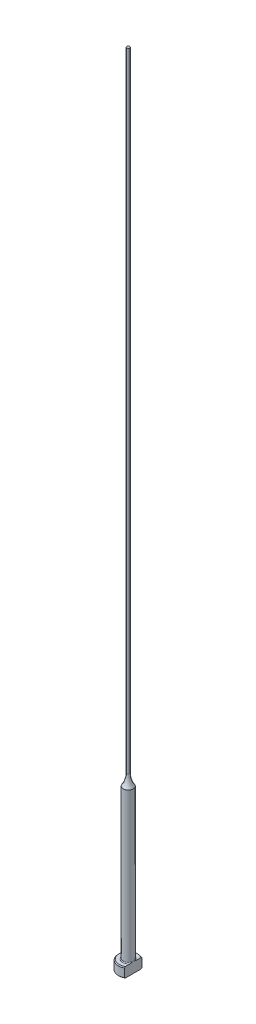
ISO-10303-21;
HEADER;
FILE_DESCRIPTION(('STEP AP214'),'2;1');
FILE_NAME('part.step','',(''),(''),'','','');
FILE_SCHEMA(('AUTOMOTIVE_DESIGN { 1 0 10303 214 1 1 1 1 }'));
ENDSEC;
DATA;
#1=APPLICATION_CONTEXT('core data for automotive mechanical design processes');
#2=APPLICATION_PROTOCOL_DEFINITION('international standard','automotive_design',2000,#1);
#3=PRODUCT_CONTEXT('',#1,'mechanical');
#4=PRODUCT('Part','Part','',(#3));
#5=PRODUCT_RELATED_PRODUCT_CATEGORY('part','',(#4));
#6=PRODUCT_DEFINITION_FORMATION('','',#4);
#7=PRODUCT_DEFINITION_CONTEXT('part definition',#1,'design');
#8=PRODUCT_DEFINITION('design','',#6,#7);
#9=PRODUCT_DEFINITION_SHAPE('','',#8);
#10=(LENGTH_UNIT() NAMED_UNIT(*) SI_UNIT(.MILLI.,.METRE.));
#11=(NAMED_UNIT(*) PLANE_ANGLE_UNIT() SI_UNIT($,.RADIAN.));
#12=(NAMED_UNIT(*) SI_UNIT($,.STERADIAN.) SOLID_ANGLE_UNIT());
#13=UNCERTAINTY_MEASURE_WITH_UNIT(LENGTH_MEASURE(1.E-05),#10,'distance_accuracy_value','');
#14=(GEOMETRIC_REPRESENTATION_CONTEXT(3) GLOBAL_UNCERTAINTY_ASSIGNED_CONTEXT((#13)) GLOBAL_UNIT_ASSIGNED_CONTEXT((#10,
#11,#12)) REPRESENTATION_CONTEXT('',''));
#15=CARTESIAN_POINT('',(0.,0.,0.));
#16=DIRECTION('',(0.,0.,1.));
#17=DIRECTION('',(1.,0.,0.));
#18=AXIS2_PLACEMENT_3D('',#15,#16,#17);
#19=CARTESIAN_POINT('',(-3.17499999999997,3.175,0.));
#20=DIRECTION('',(0.,1.,0.));
#21=DIRECTION('',(0.,0.,1.));
#22=AXIS2_PLACEMENT_3D('',#19,#20,#21);
#23=PLANE('',#22);
#24=CARTESIAN_POINT('',(0.,3.175,0.));
#25=DIRECTION('',(0.,1.,0.));
#26=DIRECTION('',(0.,0.,1.));
#27=AXIS2_PLACEMENT_3D('',#24,#25,#26);
#28=CIRCLE('',#27,2.92099999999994);
#29=CARTESIAN_POINT('',(1.58749999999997,3.175,-2.45195529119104));
#30=VERTEX_POINT('',#29);
#31=CARTESIAN_POINT('',(1.58749999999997,3.175,2.45195529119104));
#32=VERTEX_POINT('',#31);
#33=EDGE_CURVE('E105',#30,#32,#28,.T.);
#34=ORIENTED_EDGE('',*,*,#33,.T.);
#35=DIRECTION('',(0.,0.,1.));
#36=VECTOR('',#35,1.);
#37=CARTESIAN_POINT('',(1.58749999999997,3.17499999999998,2.74963065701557));
#38=LINE('',#37,#36);
#39=CARTESIAN_POINT('',(1.58749999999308,3.175,0.933255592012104));
#40=VERTEX_POINT('',#39);
#41=EDGE_CURVE('E126',#40,#32,#38,.T.);
#42=ORIENTED_EDGE('',*,*,#41,.F.);
#43=CARTESIAN_POINT('',(0.,3.175,0.));
#44=DIRECTION('',(0.,1.,0.));
#45=DIRECTION('',(0.,0.,1.));
#46=AXIS2_PLACEMENT_3D('',#43,#44,#45);
#47=CIRCLE('',#46,1.84149999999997);
#48=CARTESIAN_POINT('',(1.58749999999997,3.17500000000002,-0.933255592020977));
#49=VERTEX_POINT('',#48);
#50=EDGE_CURVE('E11',#40,#49,#47,.F.);
#51=ORIENTED_EDGE('',*,*,#50,.T.);
#52=EDGE_CURVE('E52',#30,#49,#38,.T.);
#53=ORIENTED_EDGE('',*,*,#52,.F.);
#54=EDGE_LOOP('',(#34,#42,#51,#53));
#55=FACE_BOUND('',#54,.T.);
#56=ADVANCED_FACE('F32',(#55),#23,.T.);
#57=CARTESIAN_POINT('',(0.,259.958771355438,0.));
#58=DIRECTION('',(0.,1.,0.));
#59=DIRECTION('',(0.,0.,1.));
#60=AXIS2_PLACEMENT_3D('',#57,#58,#59);
#61=CYLINDRICAL_SURFACE('',#60,3.17499999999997);
#62=CARTESIAN_POINT('',(0.,2.92100000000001,0.));
#63=DIRECTION('',(0.,1.,0.));
#64=DIRECTION('',(0.,0.,1.));
#65=AXIS2_PLACEMENT_3D('',#62,#63,#64);
#66=CIRCLE('',#65,3.17499999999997);
#67=CARTESIAN_POINT('',(1.58749999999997,2.92100000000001,2.74963065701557));
#68=VERTEX_POINT('',#67);
#69=CARTESIAN_POINT('',(1.58749999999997,2.92100000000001,-2.74963065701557));
#70=VERTEX_POINT('',#69);
#71=EDGE_CURVE('E98',#68,#70,#66,.F.);
#72=ORIENTED_EDGE('',*,*,#71,.T.);
#73=DIRECTION('',(0.,-1.,0.));
#74=VECTOR('',#73,1.);
#75=CARTESIAN_POINT('',(1.58749999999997,254.001,-2.74963065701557));
#76=LINE('',#75,#74);
#77=CARTESIAN_POINT('',(1.58749999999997,0.253999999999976,-2.74963065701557));
#78=VERTEX_POINT('',#77);
#79=EDGE_CURVE('E141',#70,#78,#76,.T.);
#80=ORIENTED_EDGE('',*,*,#79,.T.);
#81=CARTESIAN_POINT('',(0.,0.253999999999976,0.));
#82=DIRECTION('',(0.,-1.,0.));
#83=DIRECTION('',(0.,0.,-1.));
#84=AXIS2_PLACEMENT_3D('',#81,#82,#83);
#85=CIRCLE('',#84,3.17499999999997);
#86=CARTESIAN_POINT('',(1.58749999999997,0.253999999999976,2.74963065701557));
#87=VERTEX_POINT('',#86);
#88=EDGE_CURVE('E95',#78,#87,#85,.F.);
#89=ORIENTED_EDGE('',*,*,#88,.T.);
#90=DIRECTION('',(0.,-1.,0.));
#91=VECTOR('',#90,1.);
#92=CARTESIAN_POINT('',(1.58749999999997,254.001,2.74963065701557));
#93=LINE('',#92,#91);
#94=EDGE_CURVE('E88',#68,#87,#93,.T.);
#95=ORIENTED_EDGE('',*,*,#94,.F.);
#96=EDGE_LOOP('',(#72,#80,#89,#95));
#97=FACE_BOUND('',#96,.T.);
#98=ADVANCED_FACE('F191',(#97),#61,.T.);
#99=CARTESIAN_POINT('',(0.,0.,0.));
#100=DIRECTION('',(0.,-1.,0.));
#101=DIRECTION('',(0.,0.,-1.));
#102=AXIS2_PLACEMENT_3D('',#99,#100,#101);
#103=PLANE('',#102);
#104=CARTESIAN_POINT('',(0.,0.,0.));
#105=DIRECTION('',(0.,-1.,0.));
#106=DIRECTION('',(0.,0.,-1.));
#107=AXIS2_PLACEMENT_3D('',#104,#105,#106);
#108=CIRCLE('',#107,2.92100000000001);
#109=CARTESIAN_POINT('',(1.58749999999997,0.,2.45195529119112));
#110=VERTEX_POINT('',#109);
#111=CARTESIAN_POINT('',(1.58749999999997,0.,-2.45195529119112));
#112=VERTEX_POINT('',#111);
#113=EDGE_CURVE('E93',#110,#112,#108,.T.);
#114=ORIENTED_EDGE('',*,*,#113,.T.);
#115=DIRECTION('',(0.,0.,1.));
#116=VECTOR('',#115,1.);
#117=CARTESIAN_POINT('',(1.58749999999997,0.,2.74963065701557));
#118=LINE('',#117,#116);
#119=EDGE_CURVE('E78',#112,#110,#118,.T.);
#120=ORIENTED_EDGE('',*,*,#119,.T.);
#121=EDGE_LOOP('',(#114,#120));
#122=FACE_BOUND('',#121,.T.);
#123=ADVANCED_FACE('F97',(#122),#103,.T.);
#124=CARTESIAN_POINT('',(0.,3.17499999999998,0.));
#125=DIRECTION('',(0.,-1.,0.));
#126=DIRECTION('',(0.,0.,-1.));
#127=AXIS2_PLACEMENT_3D('',#124,#125,#126);
#128=CONICAL_SURFACE('',#127,2.92099999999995,0.785398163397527);
#129=ORIENTED_EDGE('',*,*,#71,.F.);
#130=CARTESIAN_POINT('',(1.58749999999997,-0.16162066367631,-6.0529050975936));
#131=CARTESIAN_POINT('',(1.58749999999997,-0.0288893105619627,-5.91567682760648));
#132=CARTESIAN_POINT('',(1.58749999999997,0.103699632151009,-5.7783103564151));
#133=CARTESIAN_POINT('',(1.58749999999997,0.368508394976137,-5.50321874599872));
#134=CARTESIAN_POINT('',(1.58749999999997,0.500728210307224,-5.36549360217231));
#135=CARTESIAN_POINT('',(1.58749999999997,0.764778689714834,-5.08953516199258));
#136=CARTESIAN_POINT('',(1.58749999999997,0.896609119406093,-4.9513016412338));
#137=CARTESIAN_POINT('',(1.58749999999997,1.15968706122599,-4.67428233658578));
#138=CARTESIAN_POINT('',(1.58749999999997,1.29093457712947,-4.53549655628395));
#139=CARTESIAN_POINT('',(1.58749999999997,1.55007705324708,-4.25997724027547));
#140=CARTESIAN_POINT('',(1.58749999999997,1.67798684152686,-4.12325766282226));
#141=CARTESIAN_POINT('',(1.58749999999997,1.9328486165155,-3.84892898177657));
#142=CARTESIAN_POINT('',(1.58749999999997,2.05980060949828,-3.71131988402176));
#143=CARTESIAN_POINT('',(1.58749999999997,2.31237508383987,-3.43493978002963));
#144=CARTESIAN_POINT('',(1.58749999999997,2.43799784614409,-3.29616903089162));
#145=CARTESIAN_POINT('',(1.58749999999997,2.68741369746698,-3.01699558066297));
#146=CARTESIAN_POINT('',(1.58749999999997,2.81120686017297,-2.8765929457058));
#147=CARTESIAN_POINT('',(1.58749999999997,3.00875865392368,-2.64816703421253));
#148=CARTESIAN_POINT('',(1.58749999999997,3.08336151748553,-2.56087478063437));
#149=CARTESIAN_POINT('',(1.58749999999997,3.2312387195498,-2.38515423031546));
#150=CARTESIAN_POINT('',(1.58749999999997,3.30451292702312,-2.29672582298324));
#151=CARTESIAN_POINT('',(1.58749999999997,3.45004422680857,-2.1174740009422));
#152=CARTESIAN_POINT('',(1.58749999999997,3.5222823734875,-2.02663514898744));
#153=CARTESIAN_POINT('',(1.58749999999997,3.66423097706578,-1.8430252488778));
#154=CARTESIAN_POINT('',(1.58749999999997,3.73394203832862,-1.75025467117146));
#155=CARTESIAN_POINT('',(1.58749999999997,3.87080633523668,-1.5606747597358));
#156=CARTESIAN_POINT('',(1.58749999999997,3.93790459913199,-1.46382547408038));
#157=CARTESIAN_POINT('',(1.58749999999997,4.06669147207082,-1.26632594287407));
#158=CARTESIAN_POINT('',(1.58749999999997,4.1283726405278,-1.16567073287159));
#159=CARTESIAN_POINT('',(1.58749999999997,4.21402252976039,-1.01165766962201));
#160=CARTESIAN_POINT('',(1.58749999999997,4.24127929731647,-0.960142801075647));
#161=CARTESIAN_POINT('',(1.58749999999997,4.2930979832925,-0.855780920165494));
#162=CARTESIAN_POINT('',(1.58749999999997,4.31765941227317,-0.802933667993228));
#163=CARTESIAN_POINT('',(1.58749999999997,4.38614656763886,-0.642461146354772));
#164=CARTESIAN_POINT('',(1.58749999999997,4.42510149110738,-0.532518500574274));
#165=CARTESIAN_POINT('',(1.58749999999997,4.46726244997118,-0.367680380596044));
#166=CARTESIAN_POINT('',(1.58749999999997,4.47844427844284,-0.314802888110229));
#167=CARTESIAN_POINT('',(1.58749999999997,4.49576654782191,-0.208209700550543));
#168=CARTESIAN_POINT('',(1.58749999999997,4.50190743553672,-0.154494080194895));
#169=CARTESIAN_POINT('',(1.58749999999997,4.50871296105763,-0.0468792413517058));
#170=CARTESIAN_POINT('',(1.58749999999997,4.5093945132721,0.00701889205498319));
#171=CARTESIAN_POINT('',(1.58749999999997,4.50527679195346,0.114606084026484));
#172=CARTESIAN_POINT('',(1.58749999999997,4.50047706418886,0.168295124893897));
#173=CARTESIAN_POINT('',(1.58749999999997,4.48579689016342,0.27448544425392));
#174=CARTESIAN_POINT('',(1.58749999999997,4.47596081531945,0.32699298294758));
#175=CARTESIAN_POINT('',(1.58749999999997,4.45181809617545,0.430974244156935));
#176=CARTESIAN_POINT('',(1.58749999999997,4.4375096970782,0.482447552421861));
#177=CARTESIAN_POINT('',(1.58749999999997,4.40502489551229,0.584460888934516));
#178=CARTESIAN_POINT('',(1.58749999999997,4.386827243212,0.634994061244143));
#179=CARTESIAN_POINT('',(1.58749999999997,4.34729308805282,0.734789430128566));
#180=CARTESIAN_POINT('',(1.58749999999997,4.3259572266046,0.784051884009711));
#181=CARTESIAN_POINT('',(1.58749999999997,4.25791922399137,0.930549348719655));
#182=CARTESIAN_POINT('',(1.58749999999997,4.20736047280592,1.0259880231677));
#183=CARTESIAN_POINT('',(1.58749999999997,4.0995545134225,1.21304313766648));
#184=CARTESIAN_POINT('',(1.58749999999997,4.04229912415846,1.30465471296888));
#185=CARTESIAN_POINT('',(1.58749999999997,3.92308746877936,1.48526211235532));
#186=CARTESIAN_POINT('',(1.58749999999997,3.86111349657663,1.57424615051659));
#187=CARTESIAN_POINT('',(1.58749999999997,3.73408621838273,1.74990003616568));
#188=CARTESIAN_POINT('',(1.58749999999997,3.66903444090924,1.83657099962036));
#189=CARTESIAN_POINT('',(1.58749999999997,3.53583371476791,2.00931764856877));
#190=CARTESIAN_POINT('',(1.58749999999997,3.46765527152,2.09537048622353));
#191=CARTESIAN_POINT('',(1.58749999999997,3.32960643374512,2.26611736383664));
#192=CARTESIAN_POINT('',(1.58749999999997,3.25973586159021,2.35081125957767));
#193=CARTESIAN_POINT('',(1.58749999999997,3.04858139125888,2.60290121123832));
#194=CARTESIAN_POINT('',(1.58749999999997,2.90542388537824,2.76872537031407));
#195=CARTESIAN_POINT('',(1.58749999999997,2.64069522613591,3.06970913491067));
#196=CARTESIAN_POINT('',(1.58749999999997,2.51959458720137,3.20528660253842));
#197=CARTESIAN_POINT('',(1.58749999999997,2.27590400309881,3.47510321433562));
#198=CARTESIAN_POINT('',(1.58749999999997,2.15331401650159,3.60934232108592));
#199=CARTESIAN_POINT('',(1.58749999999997,1.90694239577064,3.87695374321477));
#200=CARTESIAN_POINT('',(1.58749999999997,1.78315974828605,4.0103251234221));
#201=CARTESIAN_POINT('',(1.58749999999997,1.53478104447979,4.27630880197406));
#202=CARTESIAN_POINT('',(1.58749999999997,1.41018498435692,4.40892109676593));
#203=CARTESIAN_POINT('',(1.58749999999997,1.0457468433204,4.79499418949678));
#204=CARTESIAN_POINT('',(1.58749999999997,0.80507680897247,5.04767313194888));
#205=CARTESIAN_POINT('',(1.58749999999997,0.443121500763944,5.42550911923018));
#206=CARTESIAN_POINT('',(1.58749999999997,0.322378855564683,5.55118772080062));
#207=CARTESIAN_POINT('',(1.58749999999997,0.0805914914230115,5.80225207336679));
#208=CARTESIAN_POINT('',(1.58749999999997,-0.040453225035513,5.92763782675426));
#209=CARTESIAN_POINT('',(1.58749999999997,-0.161620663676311,6.0529050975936));
#210=B_SPLINE_CURVE_WITH_KNOTS('',3,(#130,#131,#132,#133,#134,#135,#136,#137,#138,#139,#140,
#141,#142,#143,#144,#145,#146,#147,#148,#149,#150,#151,#152,#153,#154,#155,#156,#157,#158,#159,
#160,#161,#162,#163,#164,#165,#166,#167,#168,#169,#170,#171,#172,#173,#174,#175,#176,#177,#178,
#179,#180,#181,#182,#183,#184,#185,#186,#187,#188,#189,#190,#191,#192,#193,#194,#195,#196,#197,
#198,#199,#200,#201,#202,#203,#204,#205,#206,#207,#208,#209),.UNSPECIFIED.,.F.,.F.,(4,2,2,2,2,2,
2,2,2,2,2,2,2,2,2,2,2,2,2,2,2,2,2,2,2,2,2,2,2,2,2,2,2,2,2,2,2,2,2,4),(0.,0.572750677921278,
1.14550874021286,1.71856057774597,2.29160869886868,2.85328006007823,3.4149477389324,
3.97649423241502,4.53801804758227,4.88249307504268,5.22700189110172,5.5751532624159,
5.92322081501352,6.27657800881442,6.63041319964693,6.80518126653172,6.9799810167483,
7.3282426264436,7.49018491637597,7.65211285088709,7.81353889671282,7.97497832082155,
8.13501929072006,8.29512313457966,8.45612518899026,8.61709438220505,8.94062993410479,
9.2645649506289,9.58978187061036,9.91483894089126,10.2441741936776,10.5735441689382,
11.2306812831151,11.7760337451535,12.3214014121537,12.8672825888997,13.4131663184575,
14.4600164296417,14.9828595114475,15.5056983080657),.UNSPECIFIED.);
#211=EDGE_CURVE('E118',#32,#68,#210,.T.);
#212=ORIENTED_EDGE('',*,*,#211,.F.);
#213=ORIENTED_EDGE('',*,*,#33,.F.);
#214=EDGE_CURVE('E117',#70,#30,#210,.T.);
#215=ORIENTED_EDGE('',*,*,#214,.F.);
#216=EDGE_LOOP('',(#129,#212,#213,#215));
#217=FACE_BOUND('',#216,.T.);
#218=ADVANCED_FACE('F162',(#217),#128,.T.);
#219=CARTESIAN_POINT('',(0.,0.253999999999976,0.));
#220=DIRECTION('',(0.,1.,0.));
#221=DIRECTION('',(0.,0.,1.));
#222=AXIS2_PLACEMENT_3D('',#219,#220,#221);
#223=CONICAL_SURFACE('',#222,3.17499999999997,0.785398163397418);
#224=ORIENTED_EDGE('',*,*,#88,.F.);
#225=CARTESIAN_POINT('',(1.58749999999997,3.33662066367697,6.0529050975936));
#226=CARTESIAN_POINT('',(1.58749999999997,3.20388931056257,5.91567682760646));
#227=CARTESIAN_POINT('',(1.58749999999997,3.07130036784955,5.77831035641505));
#228=CARTESIAN_POINT('',(1.58749999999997,2.80649160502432,5.50321874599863));
#229=CARTESIAN_POINT('',(1.58749999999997,2.67427178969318,5.3654936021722));
#230=CARTESIAN_POINT('',(1.58749999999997,2.41022131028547,5.08953516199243));
#231=CARTESIAN_POINT('',(1.58749999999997,2.27839088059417,4.95130164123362));
#232=CARTESIAN_POINT('',(1.58749999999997,2.01531293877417,4.67428233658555));
#233=CARTESIAN_POINT('',(1.58749999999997,1.88406542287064,4.5354965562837));
#234=CARTESIAN_POINT('',(1.58749999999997,1.62492294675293,4.25997724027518));
#235=CARTESIAN_POINT('',(1.58749999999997,1.49701315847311,4.12325766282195));
#236=CARTESIAN_POINT('',(1.58749999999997,1.24215138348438,3.84892898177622));
#237=CARTESIAN_POINT('',(1.58749999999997,1.11519939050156,3.71131988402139));
#238=CARTESIAN_POINT('',(1.58749999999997,0.862624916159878,3.43493978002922));
#239=CARTESIAN_POINT('',(1.58749999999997,0.737002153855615,3.29616903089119));
#240=CARTESIAN_POINT('',(1.58749999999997,0.487586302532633,3.01699558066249));
#241=CARTESIAN_POINT('',(1.58749999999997,0.363793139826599,2.8765929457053));
#242=CARTESIAN_POINT('',(1.58749999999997,0.166241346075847,2.64816703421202));
#243=CARTESIAN_POINT('',(1.58749999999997,0.0916384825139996,2.56087478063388));
#244=CARTESIAN_POINT('',(1.58749999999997,-0.0562387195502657,2.385154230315));
#245=CARTESIAN_POINT('',(1.58749999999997,-0.129512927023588,2.29672582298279));
#246=CARTESIAN_POINT('',(1.58749999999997,-0.27504422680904,2.11747400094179));
#247=CARTESIAN_POINT('',(1.58749999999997,-0.347282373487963,2.02663514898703));
#248=CARTESIAN_POINT('',(1.58749999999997,-0.489230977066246,1.84302524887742));
#249=CARTESIAN_POINT('',(1.58749999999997,-0.558942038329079,1.7502546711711));
#250=CARTESIAN_POINT('',(1.58749999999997,-0.695806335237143,1.56067475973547));
#251=CARTESIAN_POINT('',(1.58749999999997,-0.762904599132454,1.46382547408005));
#252=CARTESIAN_POINT('',(1.58749999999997,-0.891691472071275,1.26632594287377));
#253=CARTESIAN_POINT('',(1.58749999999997,-0.953372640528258,1.16567073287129));
#254=CARTESIAN_POINT('',(1.58749999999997,-1.03902252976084,1.01165766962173));
#255=CARTESIAN_POINT('',(1.58749999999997,-1.06627929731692,0.960142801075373));
#256=CARTESIAN_POINT('',(1.58749999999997,-1.11809798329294,0.85578092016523));
#257=CARTESIAN_POINT('',(1.58749999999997,-1.14265941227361,0.802933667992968));
#258=CARTESIAN_POINT('',(1.58749999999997,-1.21114656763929,0.642461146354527));
#259=CARTESIAN_POINT('',(1.58749999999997,-1.2501014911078,0.532518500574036));
#260=CARTESIAN_POINT('',(1.58749999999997,-1.29226244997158,0.367680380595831));
#261=CARTESIAN_POINT('',(1.58749999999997,-1.30344427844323,0.314802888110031));
#262=CARTESIAN_POINT('',(1.58749999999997,-1.32076654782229,0.208209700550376));
#263=CARTESIAN_POINT('',(1.58749999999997,-1.3269074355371,0.154494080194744));
#264=CARTESIAN_POINT('',(1.58749999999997,-1.333712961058,0.0468792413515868));
#265=CARTESIAN_POINT('',(1.58749999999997,-1.33439451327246,-0.00701889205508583));
#266=CARTESIAN_POINT('',(1.58749999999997,-1.33027679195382,-0.114606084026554));
#267=CARTESIAN_POINT('',(1.58749999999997,-1.32547706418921,-0.168295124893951));
#268=CARTESIAN_POINT('',(1.58749999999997,-1.31079689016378,-0.274485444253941));
#269=CARTESIAN_POINT('',(1.58749999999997,-1.3009608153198,-0.326992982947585));
#270=CARTESIAN_POINT('',(1.58749999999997,-1.27681809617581,-0.430974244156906));
#271=CARTESIAN_POINT('',(1.58749999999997,-1.26250969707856,-0.482447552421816));
#272=CARTESIAN_POINT('',(1.58749999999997,-1.23002489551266,-0.584460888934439));
#273=CARTESIAN_POINT('',(1.58749999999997,-1.21182724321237,-0.634994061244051));
#274=CARTESIAN_POINT('',(1.58749999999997,-1.1722930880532,-0.734789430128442));
#275=CARTESIAN_POINT('',(1.58749999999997,-1.15095722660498,-0.784051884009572));
#276=CARTESIAN_POINT('',(1.58749999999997,-1.08291922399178,-0.93054934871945));
#277=CARTESIAN_POINT('',(1.58749999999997,-1.03236047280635,-1.02598802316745));
#278=CARTESIAN_POINT('',(1.58749999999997,-0.924554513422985,-1.21304313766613));
#279=CARTESIAN_POINT('',(1.58749999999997,-0.86729912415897,-1.30465471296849));
#280=CARTESIAN_POINT('',(1.58749999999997,-0.748087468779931,-1.48526211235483));
#281=CARTESIAN_POINT('',(1.58749999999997,-0.686113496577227,-1.57424615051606));
#282=CARTESIAN_POINT('',(1.58749999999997,-0.55908621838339,-1.74990003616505));
#283=CARTESIAN_POINT('',(1.58749999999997,-0.494034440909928,-1.83657099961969));
#284=CARTESIAN_POINT('',(1.58749999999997,-0.360833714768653,-2.00931764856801));
#285=CARTESIAN_POINT('',(1.58749999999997,-0.292655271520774,-2.09537048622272));
#286=CARTESIAN_POINT('',(1.58749999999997,-0.154606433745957,-2.26611736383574));
#287=CARTESIAN_POINT('',(1.58749999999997,-0.0847358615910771,-2.35081125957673));
#288=CARTESIAN_POINT('',(1.58749999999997,0.126418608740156,-2.60290121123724));
#289=CARTESIAN_POINT('',(1.58749999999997,0.269576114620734,-2.76872537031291));
#290=CARTESIAN_POINT('',(1.58749999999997,0.534304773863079,-3.06970913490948));
#291=CARTESIAN_POINT('',(1.58749999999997,0.655405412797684,-3.20528660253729));
#292=CARTESIAN_POINT('',(1.58749999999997,0.899095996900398,-3.47510321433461));
#293=CARTESIAN_POINT('',(1.58749999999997,1.02168598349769,-3.60934232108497));
#294=CARTESIAN_POINT('',(1.58749999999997,1.26805760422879,-3.87695374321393));
#295=CARTESIAN_POINT('',(1.58749999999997,1.39184025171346,-4.01032512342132));
#296=CARTESIAN_POINT('',(1.58749999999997,1.64021895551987,-4.2763088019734));
#297=CARTESIAN_POINT('',(1.58749999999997,1.76481501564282,-4.40892109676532));
#298=CARTESIAN_POINT('',(1.58749999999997,2.12925315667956,-4.79499418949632));
#299=CARTESIAN_POINT('',(1.58749999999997,2.36992319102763,-5.04767313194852));
#300=CARTESIAN_POINT('',(1.58749999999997,2.73187849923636,-5.42550911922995));
#301=CARTESIAN_POINT('',(1.58749999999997,2.85262114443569,-5.55118772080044));
#302=CARTESIAN_POINT('',(1.58749999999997,3.09440850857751,-5.8022520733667));
#303=CARTESIAN_POINT('',(1.58749999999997,3.2154532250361,-5.92763782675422));
#304=CARTESIAN_POINT('',(1.58749999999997,3.33662066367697,-6.0529050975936));
#305=B_SPLINE_CURVE_WITH_KNOTS('',3,(#225,#226,#227,#228,#229,#230,#231,#232,#233,#234,#235,
#236,#237,#238,#239,#240,#241,#242,#243,#244,#245,#246,#247,#248,#249,#250,#251,#252,#253,#254,
#255,#256,#257,#258,#259,#260,#261,#262,#263,#264,#265,#266,#267,#268,#269,#270,#271,#272,#273,
#274,#275,#276,#277,#278,#279,#280,#281,#282,#283,#284,#285,#286,#287,#288,#289,#290,#291,#292,
#293,#294,#295,#296,#297,#298,#299,#300,#301,#302,#303,#304),.UNSPECIFIED.,.F.,.F.,(4,2,2,2,2,2,
2,2,2,2,2,2,2,2,2,2,2,2,2,2,2,2,2,2,2,2,2,2,2,2,2,2,2,2,2,2,2,2,2,4),(0.,0.57275067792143,
1.14550874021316,1.71856057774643,2.29160869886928,2.85328006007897,3.41494773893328,
3.97649423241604,4.53801804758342,4.88249307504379,5.2270018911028,5.57515326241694,
5.92322081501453,6.27657800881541,6.63041319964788,6.80518126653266,6.97998101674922,
7.32824262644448,7.49018491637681,7.65211285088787,7.81353889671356,7.97497832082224,
8.1350192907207,8.29512313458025,8.45612518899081,8.61709438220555,8.94062993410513,
9.26456495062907,9.58978187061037,9.91483894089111,10.2441741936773,10.5735441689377,
11.2306812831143,11.776033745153,12.3214014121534,12.8672825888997,13.4131663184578,
14.4600164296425,14.9828595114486,15.505698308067),.UNSPECIFIED.);
#306=EDGE_CURVE('E81',#112,#78,#305,.T.);
#307=ORIENTED_EDGE('',*,*,#306,.F.);
#308=ORIENTED_EDGE('',*,*,#113,.F.);
#309=EDGE_CURVE('E84',#87,#110,#305,.T.);
#310=ORIENTED_EDGE('',*,*,#309,.F.);
#311=EDGE_LOOP('',(#224,#307,#308,#310));
#312=FACE_BOUND('',#311,.T.);
#313=ADVANCED_FACE('F92',(#312),#223,.T.);
#314=CARTESIAN_POINT('',(0.,3.42900000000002,0.));
#315=DIRECTION('',(0.,1.,0.));
#316=DIRECTION('',(0.,0.,1.));
#317=AXIS2_PLACEMENT_3D('',#314,#315,#316);
#318=TOROIDAL_SURFACE('',#317,1.84149999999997,0.254);
#319=CARTESIAN_POINT('',(1.58749999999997,3.42900000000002,0.));
#320=CARTESIAN_POINT('',(1.58749999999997,3.42899942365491,-1.9220514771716E-10));
#321=CARTESIAN_POINT('',(1.58749999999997,3.42899884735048,-1.2261161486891E-07));
#322=CARTESIAN_POINT('',(1.58749999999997,3.42899773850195,-5.09676365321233E-07));
#323=CARTESIAN_POINT('',(1.58749999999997,3.42899720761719,-7.78176328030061E-07));
#324=CARTESIAN_POINT('',(1.58749999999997,3.42899614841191,-1.42307272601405E-06));
#325=CARTESIAN_POINT('',(1.58749999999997,3.42899562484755,-1.80713867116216E-06));
#326=CARTESIAN_POINT('',(1.58749999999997,3.42899463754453,-2.63494846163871E-06));
#327=CARTESIAN_POINT('',(1.58749999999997,3.42899417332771,-3.07814756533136E-06));
#328=CARTESIAN_POINT('',(1.58749999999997,3.42899261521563,-4.66897357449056E-06));
#329=CARTESIAN_POINT('',(1.58749999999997,3.42899159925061,-5.89404908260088E-06));
#330=CARTESIAN_POINT('',(1.58749999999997,3.42898979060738,-8.42427511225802E-06));
#331=CARTESIAN_POINT('',(1.58749999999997,3.42898899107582,-9.7248057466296E-06));
#332=CARTESIAN_POINT('',(1.58749999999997,3.42898598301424,-1.48060601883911E-05));
#333=CARTESIAN_POINT('',(1.58749999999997,3.42898393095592,-1.86838281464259E-05));
#334=CARTESIAN_POINT('',(1.58749999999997,3.42898057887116,-2.63261117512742E-05));
#335=CARTESIAN_POINT('',(1.58749999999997,3.42897922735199,-3.00687417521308E-05));
#336=CARTESIAN_POINT('',(1.58749999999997,3.42897347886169,-4.60276298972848E-05));
#337=CARTESIAN_POINT('',(1.58749999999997,3.42896911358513,-5.8247019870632E-05));
#338=CARTESIAN_POINT('',(1.58749999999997,3.42896211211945,-8.11070097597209E-05));
#339=CARTESIAN_POINT('',(1.58749999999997,3.42895931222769,-9.16953114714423E-05));
#340=CARTESIAN_POINT('',(1.58749999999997,3.42893712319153,-0.000168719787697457));
#341=CARTESIAN_POINT('',(1.58749999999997,3.42890881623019,-0.000232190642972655));
#342=CARTESIAN_POINT('',(1.58749999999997,3.42880276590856,-0.000479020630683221));
#343=CARTESIAN_POINT('',(1.58749999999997,3.42873165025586,-0.00066443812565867));
#344=CARTESIAN_POINT('',(1.58749999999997,3.42845137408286,-0.0013844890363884));
#345=CARTESIAN_POINT('',(1.58749999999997,3.42823526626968,-0.00191701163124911));
#346=CARTESIAN_POINT('',(1.58749999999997,3.42735449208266,-0.00409774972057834));
#347=CARTESIAN_POINT('',(1.58749999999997,3.42669768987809,-0.00574830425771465));
#348=CARTESIAN_POINT('',(1.58749999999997,3.4174405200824,-0.0289985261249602));
#349=CARTESIAN_POINT('',(1.58749999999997,3.40878325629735,-0.0505816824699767));
#350=CARTESIAN_POINT('',(1.58749999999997,3.39189297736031,-0.0929947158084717));
#351=CARTESIAN_POINT('',(1.58749999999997,3.38365605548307,-0.11382315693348));
#352=CARTESIAN_POINT('',(1.58749999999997,3.36635393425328,-0.157956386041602));
#353=CARTESIAN_POINT('',(1.58749999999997,3.35730391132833,-0.181267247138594));
#354=CARTESIAN_POINT('',(1.58749999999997,3.33936775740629,-0.228222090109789));
#355=CARTESIAN_POINT('',(1.58749999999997,3.33048420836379,-0.25186705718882));
#356=CARTESIAN_POINT('',(1.58749999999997,3.30894496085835,-0.310512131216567));
#357=CARTESIAN_POINT('',(1.58749999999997,3.29649449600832,-0.345588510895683));
#358=CARTESIAN_POINT('',(1.58749999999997,3.27296975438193,-0.415278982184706));
#359=CARTESIAN_POINT('',(1.58749999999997,3.26186987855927,-0.449884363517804));
#360=CARTESIAN_POINT('',(1.58749999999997,3.2395832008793,-0.524471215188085));
#361=CARTESIAN_POINT('',(1.58749999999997,3.22860862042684,-0.564517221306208));
#362=CARTESIAN_POINT('',(1.58749999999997,3.20902534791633,-0.645529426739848));
#363=CARTESIAN_POINT('',(1.58749999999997,3.20043582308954,-0.686500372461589));
#364=CARTESIAN_POINT('',(1.58749999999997,3.18611712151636,-0.771546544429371));
#365=CARTESIAN_POINT('',(1.58749999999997,3.18059550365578,-0.815658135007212));
#366=CARTESIAN_POINT('',(1.58749999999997,3.17455396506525,-0.904117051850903));
#367=CARTESIAN_POINT('',(1.58749999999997,3.17401361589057,-0.948462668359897));
#368=CARTESIAN_POINT('',(1.58749999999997,3.17898948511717,-1.02531896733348));
#369=CARTESIAN_POINT('',(1.58749999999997,3.1829739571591,-1.05792141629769));
#370=CARTESIAN_POINT('',(1.58749999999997,3.19569167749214,-1.12184393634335));
#371=CARTESIAN_POINT('',(1.58749999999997,3.20436049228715,-1.1531753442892));
#372=CARTESIAN_POINT('',(1.58749999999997,3.22236152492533,-1.19946468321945));
#373=CARTESIAN_POINT('',(1.58749999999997,3.2295150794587,-1.21526783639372));
#374=CARTESIAN_POINT('',(1.58749999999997,3.24587062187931,-1.24583726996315));
#375=CARTESIAN_POINT('',(1.58749999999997,3.25507530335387,-1.26060215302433));
#376=CARTESIAN_POINT('',(1.58749999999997,3.27378481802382,-1.28575815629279));
#377=CARTESIAN_POINT('',(1.58749999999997,3.28289001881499,-1.29644383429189));
#378=CARTESIAN_POINT('',(1.58749999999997,3.30268460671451,-1.31623154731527));
#379=CARTESIAN_POINT('',(1.58749999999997,3.31337067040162,-1.32533681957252));
#380=CARTESIAN_POINT('',(1.58749999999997,3.33349977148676,-1.33941140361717));
#381=CARTESIAN_POINT('',(1.58749999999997,3.34261446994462,-1.34484814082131));
#382=CARTESIAN_POINT('',(1.58749999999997,3.36161455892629,-1.35416329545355));
#383=CARTESIAN_POINT('',(1.58749999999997,3.37149946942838,-1.35804267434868));
#384=CARTESIAN_POINT('',(1.58749999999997,3.39188678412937,-1.36398436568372));
#385=CARTESIAN_POINT('',(1.58749999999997,3.40239309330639,-1.36603350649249));
#386=CARTESIAN_POINT('',(1.58749999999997,3.42360372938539,-1.3680840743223));
#387=CARTESIAN_POINT('',(1.58749999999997,3.43430795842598,-1.36808648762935));
#388=CARTESIAN_POINT('',(1.58749999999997,3.45433283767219,-1.36616208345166));
#389=CARTESIAN_POINT('',(1.58749999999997,3.46367506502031,-1.36444960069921));
#390=CARTESIAN_POINT('',(1.58749999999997,3.48195519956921,-1.35953338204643));
#391=CARTESIAN_POINT('',(1.58749999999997,3.49089304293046,-1.3563294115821));
#392=CARTESIAN_POINT('',(1.58749999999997,3.50850302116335,-1.34848006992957));
#393=CARTESIAN_POINT('',(1.58749999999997,3.5171531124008,-1.34378578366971));
#394=CARTESIAN_POINT('',(1.58749999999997,3.53371257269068,-1.33324445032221));
#395=CARTESIAN_POINT('',(1.58749999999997,3.54162163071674,-1.32739692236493));
#396=CARTESIAN_POINT('',(1.58749999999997,3.56107121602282,-1.31107304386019));
#397=CARTESIAN_POINT('',(1.58749999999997,3.57202221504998,-1.29989286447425));
#398=CARTESIAN_POINT('',(1.58749999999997,3.59202509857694,-1.27593566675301));
#399=CARTESIAN_POINT('',(1.58749999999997,3.60107086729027,-1.26315370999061));
#400=CARTESIAN_POINT('',(1.58749999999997,3.62186023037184,-1.22930733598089));
#401=CARTESIAN_POINT('',(1.58749999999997,3.63240584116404,-1.20751096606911));
#402=CARTESIAN_POINT('',(1.58749999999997,3.65004643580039,-1.16266144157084));
#403=CARTESIAN_POINT('',(1.58749999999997,3.65714435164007,-1.13960937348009));
#404=CARTESIAN_POINT('',(1.58749999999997,3.67265428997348,-1.07603916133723));
#405=CARTESIAN_POINT('',(1.58749999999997,3.67834921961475,-1.03486686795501));
#406=CARTESIAN_POINT('',(1.58749999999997,3.68382880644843,-0.951558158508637));
#407=CARTESIAN_POINT('',(1.58749999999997,3.68350976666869,-0.909417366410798));
#408=CARTESIAN_POINT('',(1.58749999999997,3.67745397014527,-0.811383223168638));
#409=CARTESIAN_POINT('',(1.58749999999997,3.66993873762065,-0.755610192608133));
#410=CARTESIAN_POINT('',(1.58749999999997,3.64933373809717,-0.644937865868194));
#411=CARTESIAN_POINT('',(1.58749999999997,3.63621897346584,-0.59004364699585));
#412=CARTESIAN_POINT('',(1.58749999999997,3.60740922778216,-0.485757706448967));
#413=CARTESIAN_POINT('',(1.58749999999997,3.59201096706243,-0.436281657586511));
#414=CARTESIAN_POINT('',(1.58749999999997,3.55922497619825,-0.338551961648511));
#415=CARTESIAN_POINT('',(1.58749999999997,3.5418584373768,-0.290291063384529));
#416=CARTESIAN_POINT('',(1.58749999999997,3.51760237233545,-0.225557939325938));
#417=CARTESIAN_POINT('',(1.58749999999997,3.51126413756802,-0.208874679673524));
#418=CARTESIAN_POINT('',(1.58749999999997,3.49830042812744,-0.17512392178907));
#419=CARTESIAN_POINT('',(1.58749999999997,3.49167176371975,-0.158057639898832));
#420=CARTESIAN_POINT('',(1.58749999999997,3.47585523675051,-0.117638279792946));
#421=CARTESIAN_POINT('',(1.58749999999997,3.46662970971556,-0.0943002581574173));
#422=CARTESIAN_POINT('',(1.58749999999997,3.44889695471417,-0.0497824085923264));
#423=CARTESIAN_POINT('',(1.58749999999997,3.44040039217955,-0.028598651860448));
#424=CARTESIAN_POINT('',(1.58749999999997,3.43130364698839,-0.00575168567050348));
#425=CARTESIAN_POINT('',(1.58749999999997,3.43064818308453,-0.00410451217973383));
#426=CARTESIAN_POINT('',(1.58749999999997,3.42976776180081,-0.00192459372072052));
#427=CARTESIAN_POINT('',(1.58749999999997,3.42955062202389,-0.00138952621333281));
#428=CARTESIAN_POINT('',(1.58749999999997,3.42926908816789,-0.000666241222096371));
#429=CARTESIAN_POINT('',(1.58749999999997,3.42919771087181,-0.000480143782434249));
#430=CARTESIAN_POINT('',(1.58749999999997,3.42909131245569,-0.000232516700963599));
#431=CARTESIAN_POINT('',(1.58749999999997,3.42906294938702,-0.000168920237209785));
#432=CARTESIAN_POINT('',(1.58749999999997,3.42904072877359,-9.17527162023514E-05));
#433=CARTESIAN_POINT('',(1.58749999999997,3.42903792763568,-8.11550293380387E-05));
#434=CARTESIAN_POINT('',(1.58749999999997,3.42903091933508,-5.82743948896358E-05));
#435=CARTESIAN_POINT('',(1.58749999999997,3.42902654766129,-4.60440001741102E-05));
#436=CARTESIAN_POINT('',(1.58749999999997,3.42902079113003,-3.00727682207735E-05));
#437=CARTESIAN_POINT('',(1.58749999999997,3.42901943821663,-2.63286807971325E-05));
#438=CARTESIAN_POINT('',(1.58749999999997,3.42901608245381,-1.86836529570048E-05));
#439=CARTESIAN_POINT('',(1.58749999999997,3.4290140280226,-1.48046517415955E-05));
#440=CARTESIAN_POINT('',(1.58749999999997,3.42901101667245,-9.72223943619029E-06));
#441=CARTESIAN_POINT('',(1.58749999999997,3.42901021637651,-8.42159649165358E-06));
#442=CARTESIAN_POINT('',(1.58749999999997,3.42900840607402,-5.89129729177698E-06));
#443=CARTESIAN_POINT('',(1.58749999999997,3.42900738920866,-4.66626867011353E-06));
#444=CARTESIAN_POINT('',(1.58749999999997,3.42900582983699,-3.07568803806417E-06));
#445=CARTESIAN_POINT('',(1.58749999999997,3.42900536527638,-2.63259565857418E-06));
#446=CARTESIAN_POINT('',(1.58749999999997,3.4290043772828,-1.80506085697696E-06));
#447=CARTESIAN_POINT('',(1.58749999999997,3.42900385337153,-1.42116387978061E-06));
#448=CARTESIAN_POINT('',(1.58749999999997,3.42900279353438,-7.76675643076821E-07));
#449=CARTESIAN_POINT('',(1.58749999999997,3.42900226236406,-5.08406487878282E-07));
#450=CARTESIAN_POINT('',(1.58749999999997,3.42900115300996,-1.21901887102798E-07));
#451=CARTESIAN_POINT('',(1.58749999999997,3.42900057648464,1.92251677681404E-10));
#452=CARTESIAN_POINT('',(1.58749999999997,3.42900000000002,0.));
#453=B_SPLINE_CURVE_WITH_KNOTS('',3,(#319,#320,#321,#322,#323,#324,#325,#326,#327,#328,#329,
#330,#331,#332,#333,#334,#335,#336,#337,#338,#339,#340,#341,#342,#343,#344,#345,#346,#347,#348,
#349,#350,#351,#352,#353,#354,#355,#356,#357,#358,#359,#360,#361,#362,#363,#364,#365,#366,#367,
#368,#369,#370,#371,#372,#373,#374,#375,#376,#377,#378,#379,#380,#381,#382,#383,#384,#385,#386,
#387,#388,#389,#390,#391,#392,#393,#394,#395,#396,#397,#398,#399,#400,#401,#402,#403,#404,#405,
#406,#407,#408,#409,#410,#411,#412,#413,#414,#415,#416,#417,#418,#419,#420,#421,#422,#423,#424,
#425,#426,#427,#428,#429,#430,#431,#432,#433,#434,#435,#436,#437,#438,#439,#440,#441,#442,#443,
#444,#445,#446,#447,#448,#449,#450,#451,#452),.UNSPECIFIED.,.T.,.F.,(4,2,2,2,2,2,2,2,2,2,2,2,2,
2,2,2,2,2,2,2,2,2,2,2,2,2,2,2,2,2,2,2,2,2,2,2,2,2,2,2,2,2,2,2,2,2,2,2,2,2,2,2,2,2,2,2,2,2,2,2,2,
2,2,2,2,2,4),(0.,1.72815458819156E-06,3.50429255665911E-06,5.44431004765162E-06,
7.3675525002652E-06,1.2119089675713E-05,1.66953775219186E-05,2.98160400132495E-05,
4.17409564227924E-05,8.0660475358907E-05,0.000113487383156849,0.000321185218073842,
0.000917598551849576,0.00264089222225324,0.00797105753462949,0.0777276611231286,
0.144923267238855,0.219939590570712,0.295714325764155,0.407362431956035,0.516367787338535,
0.640878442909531,0.766362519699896,0.899536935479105,1.03216495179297,1.13045740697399,
1.22743103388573,1.27935899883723,1.33135556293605,1.37333248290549,1.41522237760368,
1.44693946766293,1.47863694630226,1.51056074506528,1.54246916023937,1.57083210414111,
1.59919951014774,1.62861579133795,1.65804436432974,1.70472658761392,1.75155645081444,
1.82378709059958,1.89595619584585,2.01995471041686,2.1460932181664,2.31447224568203,
2.48361094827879,2.6389891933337,2.79283011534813,2.84637031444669,2.9012946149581,
2.97658236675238,3.04504771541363,3.05036697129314,3.05209849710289,3.05269709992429,
3.05290520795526,3.05293806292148,3.05297701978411,3.05298895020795,3.05300207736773,
3.05300665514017,3.0530114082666,3.05301333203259,3.05301527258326,3.05301704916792,
3.05301877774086),.UNSPECIFIED.);
#454=CARTESIAN_POINT('',(1.58749999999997,3.42900000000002,0.));
#455=VERTEX_POINT('',#454);
#456=EDGE_CURVE('E47',#455,#49,#453,.T.);
#457=ORIENTED_EDGE('',*,*,#456,.T.);
#458=ORIENTED_EDGE('',*,*,#50,.F.);
#459=CARTESIAN_POINT('',(1.58749999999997,3.42900000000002,0.));
#460=CARTESIAN_POINT('',(1.58749999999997,3.42900057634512,1.9220512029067E-10));
#461=CARTESIAN_POINT('',(1.58749999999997,3.42900115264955,1.22611614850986E-07));
#462=CARTESIAN_POINT('',(1.58749999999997,3.42900226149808,5.09676365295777E-07));
#463=CARTESIAN_POINT('',(1.58749999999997,3.42900279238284,7.78176328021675E-07));
#464=CARTESIAN_POINT('',(1.58749999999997,3.42900385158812,1.42307272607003E-06));
#465=CARTESIAN_POINT('',(1.58749999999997,3.42900437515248,1.80713867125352E-06));
#466=CARTESIAN_POINT('',(1.58749999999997,3.4290053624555,2.63494846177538E-06));
#467=CARTESIAN_POINT('',(1.58749999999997,3.42900582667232,3.0781475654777E-06));
#468=CARTESIAN_POINT('',(1.58749999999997,3.4290073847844,4.66897357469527E-06));
#469=CARTESIAN_POINT('',(1.58749999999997,3.42900840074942,5.89404908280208E-06));
#470=CARTESIAN_POINT('',(1.58749999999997,3.42901020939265,8.42427511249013E-06));
#471=CARTESIAN_POINT('',(1.58749999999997,3.42901100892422,9.72480574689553E-06));
#472=CARTESIAN_POINT('',(1.58749999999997,3.42901401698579,1.48060601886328E-05));
#473=CARTESIAN_POINT('',(1.58749999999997,3.42901606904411,1.86838281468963E-05));
#474=CARTESIAN_POINT('',(1.58749999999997,3.42901942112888,2.63261117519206E-05));
#475=CARTESIAN_POINT('',(1.58749999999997,3.42902077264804,3.00687417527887E-05));
#476=CARTESIAN_POINT('',(1.58749999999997,3.42902652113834,4.60276298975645E-05));
#477=CARTESIAN_POINT('',(1.58749999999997,3.4290308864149,5.82470198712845E-05));
#478=CARTESIAN_POINT('',(1.58749999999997,3.42903788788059,8.11070097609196E-05));
#479=CARTESIAN_POINT('',(1.58749999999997,3.42904068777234,9.16953114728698E-05));
#480=CARTESIAN_POINT('',(1.58749999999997,3.4290628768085,0.000168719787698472));
#481=CARTESIAN_POINT('',(1.58749999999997,3.42909118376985,0.000232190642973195));
#482=CARTESIAN_POINT('',(1.58749999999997,3.42919723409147,0.000479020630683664));
#483=CARTESIAN_POINT('',(1.58749999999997,3.42926834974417,0.000664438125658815));
#484=CARTESIAN_POINT('',(1.58749999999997,3.42954862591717,0.00138448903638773));
#485=CARTESIAN_POINT('',(1.58749999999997,3.42976473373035,0.00191701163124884));
#486=CARTESIAN_POINT('',(1.58749999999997,3.43064550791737,0.00409774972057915));
#487=CARTESIAN_POINT('',(1.58749999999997,3.43130231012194,0.00574830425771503));
#488=CARTESIAN_POINT('',(1.58749999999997,3.44055947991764,0.0289985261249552));
#489=CARTESIAN_POINT('',(1.58749999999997,3.44921674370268,0.0505816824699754));
#490=CARTESIAN_POINT('',(1.58749999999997,3.46610702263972,0.0929947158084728));
#491=CARTESIAN_POINT('',(1.58749999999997,3.47434394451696,0.11382315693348));
#492=CARTESIAN_POINT('',(1.58749999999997,3.49164606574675,0.157956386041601));
#493=CARTESIAN_POINT('',(1.58749999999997,3.5006960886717,0.181267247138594));
#494=CARTESIAN_POINT('',(1.58749999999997,3.51863224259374,0.228222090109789));
#495=CARTESIAN_POINT('',(1.58749999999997,3.52751579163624,0.25186705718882));
#496=CARTESIAN_POINT('',(1.58749999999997,3.54905503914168,0.310512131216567));
#497=CARTESIAN_POINT('',(1.58749999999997,3.56150550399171,0.345588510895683));
#498=CARTESIAN_POINT('',(1.58749999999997,3.5850302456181,0.415278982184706));
#499=CARTESIAN_POINT('',(1.58749999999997,3.59613012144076,0.449884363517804));
#500=CARTESIAN_POINT('',(1.58749999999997,3.61841679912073,0.524471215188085));
#501=CARTESIAN_POINT('',(1.58749999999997,3.62939137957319,0.564517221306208));
#502=CARTESIAN_POINT('',(1.58749999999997,3.6489746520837,0.645529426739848));
#503=CARTESIAN_POINT('',(1.58749999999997,3.65756417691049,0.686500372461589));
#504=CARTESIAN_POINT('',(1.58749999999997,3.67188287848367,0.771546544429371));
#505=CARTESIAN_POINT('',(1.58749999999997,3.67740449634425,0.815658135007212));
#506=CARTESIAN_POINT('',(1.58749999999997,3.68344603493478,0.904117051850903));
#507=CARTESIAN_POINT('',(1.58749999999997,3.68398638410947,0.948462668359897));
#508=CARTESIAN_POINT('',(1.58749999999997,3.67901051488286,1.02531896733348));
#509=CARTESIAN_POINT('',(1.58749999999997,3.67502604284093,1.05792141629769));
#510=CARTESIAN_POINT('',(1.58749999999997,3.66230832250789,1.12184393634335));
#511=CARTESIAN_POINT('',(1.58749999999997,3.65363950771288,1.1531753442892));
#512=CARTESIAN_POINT('',(1.58749999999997,3.6356384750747,1.19946468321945));
#513=CARTESIAN_POINT('',(1.58749999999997,3.62848492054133,1.21526783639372));
#514=CARTESIAN_POINT('',(1.58749999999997,3.61212937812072,1.24583726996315));
#515=CARTESIAN_POINT('',(1.58749999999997,3.60292469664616,1.26060215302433));
#516=CARTESIAN_POINT('',(1.58749999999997,3.58421518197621,1.28575815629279));
#517=CARTESIAN_POINT('',(1.58749999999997,3.57510998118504,1.29644383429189));
#518=CARTESIAN_POINT('',(1.58749999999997,3.55531539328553,1.31623154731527));
#519=CARTESIAN_POINT('',(1.58749999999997,3.54462932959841,1.32533681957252));
#520=CARTESIAN_POINT('',(1.58749999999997,3.52450022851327,1.33941140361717));
#521=CARTESIAN_POINT('',(1.58749999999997,3.51538553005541,1.34484814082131));
#522=CARTESIAN_POINT('',(1.58749999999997,3.49638544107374,1.35416329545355));
#523=CARTESIAN_POINT('',(1.58749999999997,3.48650053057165,1.35804267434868));
#524=CARTESIAN_POINT('',(1.58749999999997,3.46611321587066,1.36398436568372));
#525=CARTESIAN_POINT('',(1.58749999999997,3.45560690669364,1.36603350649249));
#526=CARTESIAN_POINT('',(1.58749999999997,3.43439627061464,1.3680840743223));
#527=CARTESIAN_POINT('',(1.58749999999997,3.42369204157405,1.36808648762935));
#528=CARTESIAN_POINT('',(1.58749999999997,3.40366716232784,1.36616208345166));
#529=CARTESIAN_POINT('',(1.58749999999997,3.39432493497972,1.36444960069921));
#530=CARTESIAN_POINT('',(1.58749999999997,3.37604480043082,1.35953338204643));
#531=CARTESIAN_POINT('',(1.58749999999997,3.36710695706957,1.3563294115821));
#532=CARTESIAN_POINT('',(1.58749999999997,3.34949697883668,1.34848006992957));
#533=CARTESIAN_POINT('',(1.58749999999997,3.34084688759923,1.34378578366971));
#534=CARTESIAN_POINT('',(1.58749999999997,3.32428742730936,1.33324445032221));
#535=CARTESIAN_POINT('',(1.58749999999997,3.31637836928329,1.32739692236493));
#536=CARTESIAN_POINT('',(1.58749999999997,3.29692878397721,1.31107304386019));
#537=CARTESIAN_POINT('',(1.58749999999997,3.28597778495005,1.29989286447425));
#538=CARTESIAN_POINT('',(1.58749999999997,3.26597490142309,1.27593566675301));
#539=CARTESIAN_POINT('',(1.58749999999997,3.25692913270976,1.26315370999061));
#540=CARTESIAN_POINT('',(1.58749999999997,3.23613976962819,1.22930733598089));
#541=CARTESIAN_POINT('',(1.58749999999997,3.22559415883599,1.20751096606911));
#542=CARTESIAN_POINT('',(1.58749999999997,3.20795356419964,1.16266144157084));
#543=CARTESIAN_POINT('',(1.58749999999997,3.20085564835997,1.13960937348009));
#544=CARTESIAN_POINT('',(1.58749999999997,3.18534571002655,1.07603916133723));
#545=CARTESIAN_POINT('',(1.58749999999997,3.17965078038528,1.03486686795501));
#546=CARTESIAN_POINT('',(1.58749999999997,3.1741711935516,0.951558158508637));
#547=CARTESIAN_POINT('',(1.58749999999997,3.17449023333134,0.909417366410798));
#548=CARTESIAN_POINT('',(1.58749999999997,3.18054602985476,0.811383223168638));
#549=CARTESIAN_POINT('',(1.58749999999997,3.18806126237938,0.755610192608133));
#550=CARTESIAN_POINT('',(1.58749999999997,3.20866626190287,0.644937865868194));
#551=CARTESIAN_POINT('',(1.58749999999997,3.2217810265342,0.59004364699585));
#552=CARTESIAN_POINT('',(1.58749999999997,3.25059077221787,0.485757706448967));
#553=CARTESIAN_POINT('',(1.58749999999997,3.2659890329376,0.43628165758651));
#554=CARTESIAN_POINT('',(1.58749999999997,3.29877502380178,0.338551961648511));
#555=CARTESIAN_POINT('',(1.58749999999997,3.31614156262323,0.290291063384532));
#556=CARTESIAN_POINT('',(1.58749999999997,3.34039762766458,0.225557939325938));
#557=CARTESIAN_POINT('',(1.58749999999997,3.346735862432,0.208874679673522));
#558=CARTESIAN_POINT('',(1.58749999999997,3.35969957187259,0.175123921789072));
#559=CARTESIAN_POINT('',(1.58749999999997,3.3663282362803,0.15805763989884));
#560=CARTESIAN_POINT('',(1.58749999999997,3.3821447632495,0.117638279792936));
#561=CARTESIAN_POINT('',(1.58749999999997,3.39137029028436,0.0943002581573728));
#562=CARTESIAN_POINT('',(1.58749999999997,3.40910304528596,0.0497824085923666));
#563=CARTESIAN_POINT('',(1.58749999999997,3.41759960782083,0.0285986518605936));
#564=CARTESIAN_POINT('',(1.58749999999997,3.42669635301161,0.00575168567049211));
#565=CARTESIAN_POINT('',(1.58749999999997,3.42735181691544,0.00410451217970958));
#566=CARTESIAN_POINT('',(1.58749999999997,3.42823223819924,0.00192459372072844));
#567=CARTESIAN_POINT('',(1.58749999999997,3.42844937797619,0.00138952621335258));
#568=CARTESIAN_POINT('',(1.58749999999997,3.42873091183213,0.000666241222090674));
#569=CARTESIAN_POINT('',(1.58749999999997,3.42880228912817,0.000480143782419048));
#570=CARTESIAN_POINT('',(1.58749999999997,3.42890868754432,0.000232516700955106));
#571=CARTESIAN_POINT('',(1.58749999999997,3.42893705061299,0.000168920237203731));
#572=CARTESIAN_POINT('',(1.58749999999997,3.42895927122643,9.17527161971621E-05));
#573=CARTESIAN_POINT('',(1.58749999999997,3.42896207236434,8.1155029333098E-05));
#574=CARTESIAN_POINT('',(1.58749999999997,3.42896908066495,5.82743948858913E-05));
#575=CARTESIAN_POINT('',(1.58749999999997,3.42897345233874,4.60440001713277E-05));
#576=CARTESIAN_POINT('',(1.58749999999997,3.42897920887,3.00727682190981E-05));
#577=CARTESIAN_POINT('',(1.58749999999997,3.42898056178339,2.63286807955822E-05));
#578=CARTESIAN_POINT('',(1.58749999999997,3.42898391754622,1.86836529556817E-05));
#579=CARTESIAN_POINT('',(1.58749999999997,3.42898597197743,1.48046517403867E-05));
#580=CARTESIAN_POINT('',(1.58749999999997,3.42898898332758,9.72223943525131E-06));
#581=CARTESIAN_POINT('',(1.58749999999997,3.42898978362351,8.42159649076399E-06));
#582=CARTESIAN_POINT('',(1.58749999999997,3.42899159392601,5.89129729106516E-06));
#583=CARTESIAN_POINT('',(1.58749999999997,3.42899261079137,4.66626866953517E-06));
#584=CARTESIAN_POINT('',(1.58749999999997,3.42899417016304,3.0756880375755E-06));
#585=CARTESIAN_POINT('',(1.58749999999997,3.42899463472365,2.63259565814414E-06));
#586=CARTESIAN_POINT('',(1.58749999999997,3.42899562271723,1.80506085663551E-06));
#587=CARTESIAN_POINT('',(1.58749999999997,3.42899614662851,1.42116387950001E-06));
#588=CARTESIAN_POINT('',(1.58749999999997,3.42899720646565,7.7667564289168E-07));
#589=CARTESIAN_POINT('',(1.58749999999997,3.42899773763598,5.0840648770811E-07));
#590=CARTESIAN_POINT('',(1.58749999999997,3.42899884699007,1.21901887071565E-07));
#591=CARTESIAN_POINT('',(1.58749999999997,3.42899942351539,-1.92251650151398E-10));
#592=CARTESIAN_POINT('',(1.58749999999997,3.42900000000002,0.));
#593=B_SPLINE_CURVE_WITH_KNOTS('',3,(#459,#460,#461,#462,#463,#464,#465,#466,#467,#468,#469,
#470,#471,#472,#473,#474,#475,#476,#477,#478,#479,#480,#481,#482,#483,#484,#485,#486,#487,#488,
#489,#490,#491,#492,#493,#494,#495,#496,#497,#498,#499,#500,#501,#502,#503,#504,#505,#506,#507,
#508,#509,#510,#511,#512,#513,#514,#515,#516,#517,#518,#519,#520,#521,#522,#523,#524,#525,#526,
#527,#528,#529,#530,#531,#532,#533,#534,#535,#536,#537,#538,#539,#540,#541,#542,#543,#544,#545,
#546,#547,#548,#549,#550,#551,#552,#553,#554,#555,#556,#557,#558,#559,#560,#561,#562,#563,#564,
#565,#566,#567,#568,#569,#570,#571,#572,#573,#574,#575,#576,#577,#578,#579,#580,#581,#582,#583,
#584,#585,#586,#587,#588,#589,#590,#591,#592),.UNSPECIFIED.,.T.,.F.,(4,2,2,2,2,2,2,2,2,2,2,2,2,
2,2,2,2,2,2,2,2,2,2,2,2,2,2,2,2,2,2,2,2,2,2,2,2,2,2,2,2,2,2,2,2,2,2,2,2,2,2,2,2,2,2,2,2,2,2,2,2,
2,2,2,2,2,4),(0.,1.72815458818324E-06,3.50429255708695E-06,5.44431004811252E-06,
7.36755250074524E-06,1.21190896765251E-05,1.66953775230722E-05,2.98160400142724E-05,
4.17409564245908E-05,8.06604753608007E-05,0.000113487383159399,0.000321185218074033,
0.000917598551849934,0.00264089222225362,0.00797105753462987,0.077727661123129,
0.144923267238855,0.219939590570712,0.295714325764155,0.407362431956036,0.516367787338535,
0.640878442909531,0.766362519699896,0.899536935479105,1.03216495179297,1.13045740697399,
1.22743103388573,1.27935899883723,1.33135556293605,1.37333248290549,1.41522237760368,
1.44693946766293,1.47863694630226,1.51056074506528,1.54246916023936,1.57083210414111,
1.59919951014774,1.62861579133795,1.65804436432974,1.70472658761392,1.75155645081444,
1.82378709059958,1.89595619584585,2.01995471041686,2.1460932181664,2.31447224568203,
2.48361094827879,2.6389891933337,2.79283011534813,2.84637031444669,2.9012946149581,
2.97658236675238,3.04504771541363,3.05036697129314,3.05209849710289,3.05269709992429,
3.05290520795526,3.05293806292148,3.05297701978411,3.05298895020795,3.05300207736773,
3.05300665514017,3.0530114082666,3.05301333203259,3.05301527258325,3.05301704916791,
3.05301877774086),.UNSPECIFIED.);
#594=EDGE_CURVE('E147',#40,#455,#593,.T.);
#595=ORIENTED_EDGE('',*,*,#594,.T.);
#596=CARTESIAN_POINT('',(0.,3.42900000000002,0.));
#597=DIRECTION('',(0.,1.,0.));
#598=DIRECTION('',(0.,0.,1.));
#599=AXIS2_PLACEMENT_3D('',#596,#597,#598);
#600=CIRCLE('',#599,1.58749999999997);
#601=EDGE_CURVE('E40',#455,#455,#600,.T.);
#602=ORIENTED_EDGE('',*,*,#601,.F.);
#603=EDGE_LOOP('',(#457,#458,#595,#602));
#604=FACE_BOUND('',#603,.T.);
#605=ADVANCED_FACE('F34',(#604),#318,.F.);
#606=CARTESIAN_POINT('',(-0.45973999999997,254.,0.));
#607=DIRECTION('',(0.,1.,0.));
#608=DIRECTION('',(0.,0.,1.));
#609=AXIS2_PLACEMENT_3D('',#606,#607,#608);
#610=PLANE('',#609);
#611=CARTESIAN_POINT('',(0.,254.,0.));
#612=DIRECTION('',(0.,1.,0.));
#613=DIRECTION('',(0.,0.,1.));
#614=AXIS2_PLACEMENT_3D('',#611,#612,#613);
#615=CIRCLE('',#614,0.45973999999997);
#616=CARTESIAN_POINT('',(0.,254.,0.45973999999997));
#617=VERTEX_POINT('',#616);
#618=EDGE_CURVE('E108',#617,#617,#615,.T.);
#619=ORIENTED_EDGE('',*,*,#618,.T.);
#620=EDGE_LOOP('',(#619));
#621=FACE_BOUND('',#620,.T.);
#622=ADVANCED_FACE('F180',(#621),#610,.T.);
#623=CARTESIAN_POINT('',(0.,259.958771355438,0.));
#624=DIRECTION('',(0.,1.,0.));
#625=DIRECTION('',(0.,0.,1.));
#626=AXIS2_PLACEMENT_3D('',#623,#624,#625);
#627=CYLINDRICAL_SURFACE('',#626,0.45973999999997);
#628=CARTESIAN_POINT('',(0.,54.4125765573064,0.));
#629=DIRECTION('',(0.,1.,0.));
#630=DIRECTION('',(0.,0.,1.));
#631=AXIS2_PLACEMENT_3D('',#628,#629,#630);
#632=CIRCLE('',#631,0.459739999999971);
#633=CARTESIAN_POINT('',(0.,54.4125765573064,0.459739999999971));
#634=VERTEX_POINT('',#633);
#635=EDGE_CURVE('E111',#634,#634,#632,.T.);
#636=ORIENTED_EDGE('',*,*,#635,.T.);
#637=EDGE_LOOP('',(#636));
#638=FACE_BOUND('',#637,.T.);
#639=ORIENTED_EDGE('',*,*,#618,.F.);
#640=EDGE_LOOP('',(#639));
#641=FACE_BOUND('',#640,.T.);
#642=ADVANCED_FACE('F174',(#638,#641),#627,.T.);
#643=CARTESIAN_POINT('',(0.,54.4125765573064,0.));
#644=DIRECTION('',(0.,1.,0.));
#645=DIRECTION('',(0.,0.,1.));
#646=AXIS2_PLACEMENT_3D('',#643,#644,#645);
#647=TOROIDAL_SURFACE('',#646,6.80973999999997,6.35);
#648=CARTESIAN_POINT('',(0.,50.8,0.));
#649=DIRECTION('',(0.,1.,0.));
#650=DIRECTION('',(0.,0.,1.));
#651=AXIS2_PLACEMENT_3D('',#648,#649,#650);
#652=CIRCLE('',#651,1.58749999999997);
#653=CARTESIAN_POINT('',(0.,50.8,1.58749999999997));
#654=VERTEX_POINT('',#653);
#655=EDGE_CURVE('E114',#654,#654,#652,.T.);
#656=ORIENTED_EDGE('',*,*,#655,.T.);
#657=EDGE_LOOP('',(#656));
#658=FACE_BOUND('',#657,.T.);
#659=ORIENTED_EDGE('',*,*,#635,.F.);
#660=EDGE_LOOP('',(#659));
#661=FACE_BOUND('',#660,.T.);
#662=ADVANCED_FACE('F168',(#658,#661),#647,.F.);
#663=CARTESIAN_POINT('',(0.,259.958771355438,0.));
#664=DIRECTION('',(0.,1.,0.));
#665=DIRECTION('',(0.,0.,1.));
#666=AXIS2_PLACEMENT_3D('',#663,#664,#665);
#667=CYLINDRICAL_SURFACE('',#666,1.58749999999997);
#668=ORIENTED_EDGE('',*,*,#601,.T.);
#669=EDGE_LOOP('',(#668));
#670=FACE_BOUND('',#669,.T.);
#671=ORIENTED_EDGE('',*,*,#655,.F.);
#672=EDGE_LOOP('',(#671));
#673=FACE_BOUND('',#672,.T.);
#674=ADVANCED_FACE('F165',(#670,#673),#667,.T.);
#675=CARTESIAN_POINT('',(1.58749999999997,254.001,2.74963065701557));
#676=DIRECTION('',(1.,0.,0.));
#677=DIRECTION('',(0.,0.,-1.));
#678=AXIS2_PLACEMENT_3D('',#675,#676,#677);
#679=PLANE('',#678);
#680=ORIENTED_EDGE('',*,*,#309,.T.);
#681=ORIENTED_EDGE('',*,*,#119,.F.);
#682=ORIENTED_EDGE('',*,*,#306,.T.);
#683=ORIENTED_EDGE('',*,*,#79,.F.);
#684=ORIENTED_EDGE('',*,*,#214,.T.);
#685=ORIENTED_EDGE('',*,*,#52,.T.);
#686=ORIENTED_EDGE('',*,*,#456,.F.);
#687=ORIENTED_EDGE('',*,*,#594,.F.);
#688=ORIENTED_EDGE('',*,*,#41,.T.);
#689=ORIENTED_EDGE('',*,*,#211,.T.);
#690=ORIENTED_EDGE('',*,*,#94,.T.);
#691=EDGE_LOOP('',(#680,#681,#682,#683,#684,#685,#686,#687,#688,#689,#690));
#692=FACE_BOUND('',#691,.T.);
#693=ADVANCED_FACE('F80',(#692),#679,.T.);
#694=CLOSED_SHELL('',(#56,#98,#123,#218,#313,#605,#622,#642,#662,#674,#693));
#695=MANIFOLD_SOLID_BREP('B2',#694);
#696=ADVANCED_BREP_SHAPE_REPRESENTATION('',(#18,#695),#14);
#697=SHAPE_DEFINITION_REPRESENTATION(#9,#696);
ENDSEC;
END-ISO-10303-21;
